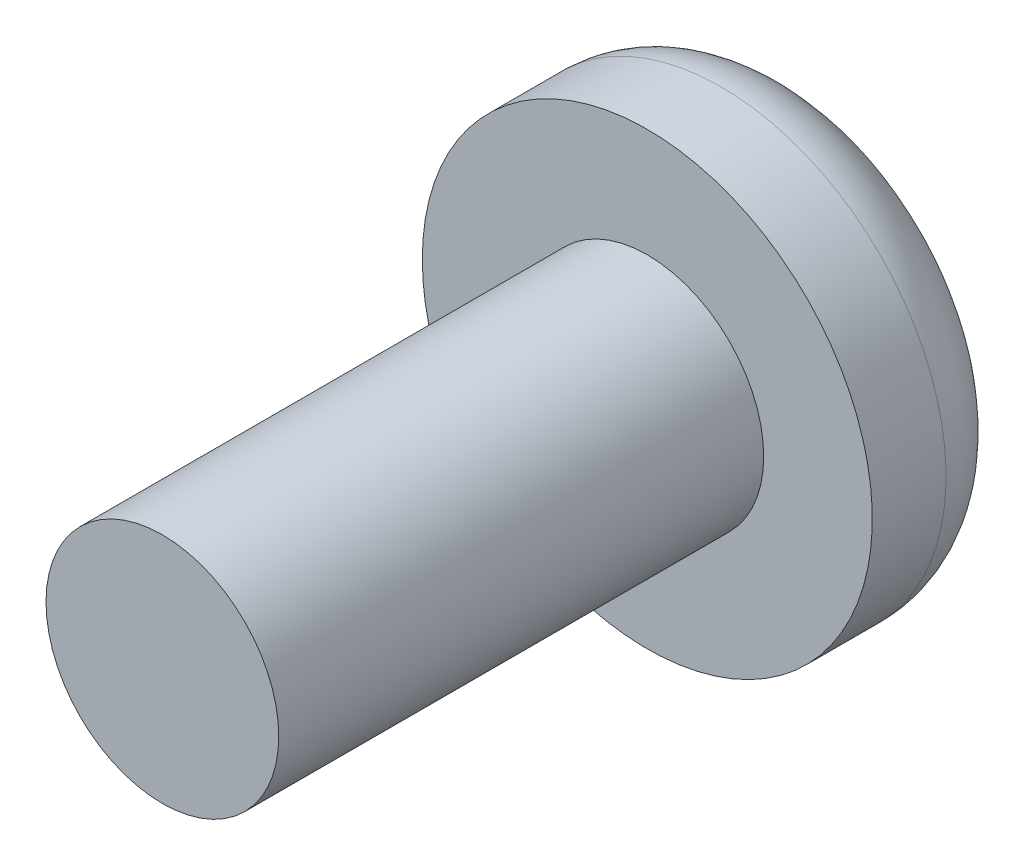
from build123d import *

# Parameters (mm, degrees)
SKETCH1_R          = 0.762
THREADS_DEPTH      = 3.175
SKETCH2_W          = 1.4732
SKETCH2_H          = 0.9906
FILLET_2_R         = 0.508
SKETCH4_W          = 0.4572
SKETCH4_H          = 0.762
CUT_EXTRUDE1_DEPTH = 0.4953
CIRPATTERN2_COUNT  = 4


with BuildPart() as part:
    # Sketch1 → THREADS (new body)
    with BuildSketch(Plane.XY):
        Circle(SKETCH1_R)
    extrude(amount=THREADS_DEPTH)

    # Sketch2 → PANHEAD (revolve)
    with BuildSketch(Plane(origin=(0, 0, 0), x_dir=(1, 0, 0), z_dir=(0, 1, 0)), mode=Mode.PRIVATE) as panhead_sk:
        with Locations((0.7366, 0.4953)):
            Rectangle(SKETCH2_W, SKETCH2_H)
    revolve(panhead_sk.sketch.rotate(Axis((0, 0, -4.840317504), (0, 0, 1)), 180), axis=Axis((0, 0, -4.840317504), (0, 0, 1)))

    # FILLET 2
    fillet_2_edges = [part.edges().sort_by_distance(p)[0] for p in [
        (1.4732, 0, -0.9906),
    ]]
    fillet(fillet_2_edges, radius=FILLET_2_R)

    # Sketch4 → Cut-Extrude1 (cut)
    with BuildSketch(Plane(origin=(-0.355935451, -0.850723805, -0.9906), x_dir=(-1, 0, 0), z_dir=(0, 0, -1))):
        with Locations((-0.355935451, 1.231723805)):
            Rectangle(SKETCH4_W, SKETCH4_H)
    cut_extrude1 = extrude(amount=-CUT_EXTRUDE1_DEPTH, mode=Mode.SUBTRACT)

    # CirPattern2: Cut-Extrude1 ×4 about axis
    cirpattern2_axis = Axis((0, 0, 0), (0, 0, 1))
    for i in range(1, CIRPATTERN2_COUNT):
        add(cut_extrude1.rotate(cirpattern2_axis, i * 360 / CIRPATTERN2_COUNT), mode=Mode.SUBTRACT)


solid = part.part
